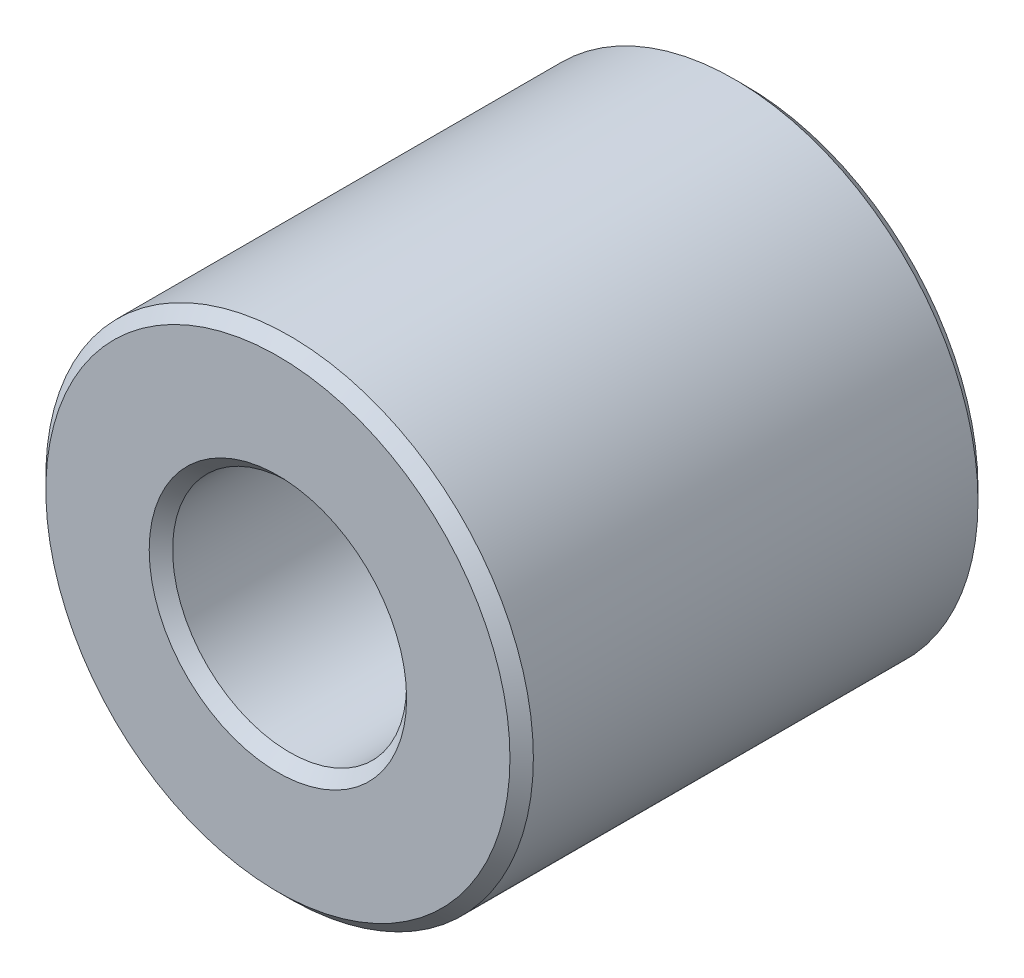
from build123d import *

# Parameters (mm, degrees)
SKETCH1_R           = 37.5
SKETCH1_R_2         = 18
BOSS_EXTRUDE1_DEPTH = 36
CHAMFER1_SIZE       = 1.8


with BuildPart() as part:
    # Sketch1 → Boss-Extrude1 (new, symmetric)
    with BuildSketch(Plane.XY):
        Circle(SKETCH1_R)
        Circle(SKETCH1_R_2, mode=Mode.SUBTRACT)
    extrude(amount=BOSS_EXTRUDE1_DEPTH, both=True)

    # Chamfer1
    chamfer1_edges = [part.edges().sort_by_distance(p)[0] for p in [
        (-37.5, 0, -36),
        (-37.5, 0, 36),
        (-18, 0, -36),
        (-18, 0, 36),
    ]]
    chamfer(chamfer1_edges, length=CHAMFER1_SIZE)


solid = part.part
